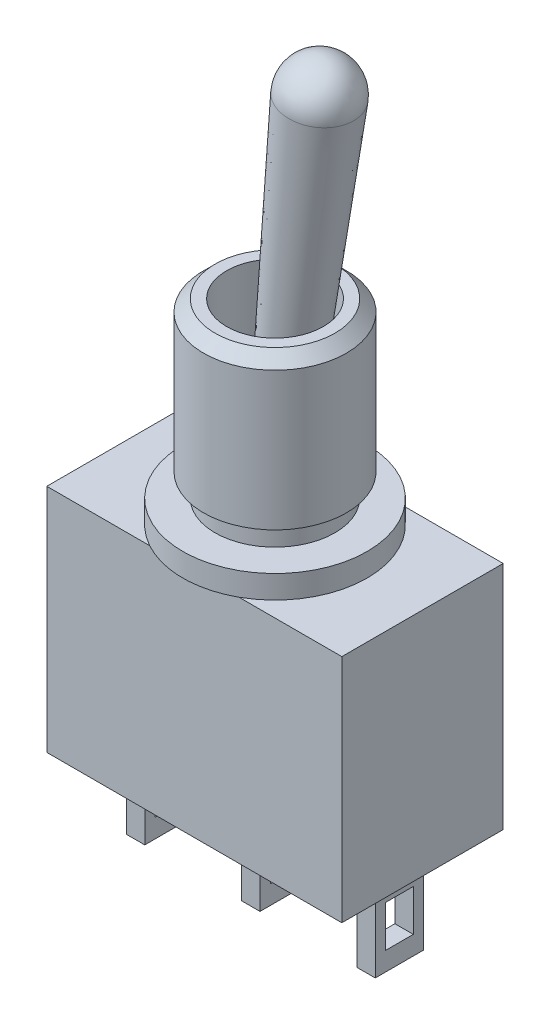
from build123d import *

# Parameters (mm, degrees)
SKETCH1_W           = 12.8
SKETCH1_H           = 10
BOSS_EXTRUDE1_DEPTH = 3.5
SKETCH4_W           = 2.1
SKETCH4_H           = 3.8
SKETCH4_W_2         = 1.2
SKETCH4_H_2         = 1.8
BOSS_EXTRUDE2_DEPTH = 0.4
LPATTERN1_COUNT     = 2
LPATTERN1_PITCH     = 5
LPATTERN1_COL_COUNT = 2
LPATTERN1_COL_PITCH = 5


with BuildPart() as part:
    # Sketch1 → Boss-Extrude1 (new, symmetric)
    with BuildSketch(Plane.XY):
        Rectangle(SKETCH1_W, SKETCH1_H)
    extrude(amount=BOSS_EXTRUDE1_DEPTH, both=True)

    # Sketch3 → Revolve1 (revolve)
    with BuildSketch(Plane.XY):
        with BuildLine():
            Line((0, 5), (0, 8.1))
            ThreePointArc((0, 8.1), (1.48492424, 7.48492424), (2.1, 6))
            Line((2.1, 6), (2.1, 13.5))
            Line((2.1, 13.5), (2.6, 13.5))
            Line((2.6, 13.5), (3.1, 13))
            Line((3.1, 13), (3.1, 7))
            Line((3.1, 7), (2.6, 7))
            Line((2.6, 7), (2.6, 6))
            Line((2.6, 6), (4, 6))
            Line((4, 6), (4, 5))
            Line((4, 5), (0, 5))
        make_face()
    revolve(axis=Axis((0, 5, 0), (0, 1, 0)))

    # Sketch4 → Boss-Extrude2 (add, symmetric)
    with BuildSketch(Plane(origin=(0, 0, 0), x_dir=(0, 0, -1), z_dir=(1, 0, 0))):
        with Locations((0, -6.9)):
            Rectangle(SKETCH4_W, SKETCH4_H)
        with Locations((0, -7.085714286)):
            Rectangle(SKETCH4_W_2, SKETCH4_H_2, mode=Mode.SUBTRACT)
    boss_extrude2 = extrude(amount=BOSS_EXTRUDE2_DEPTH, both=True)

    # LPattern1: Boss-Extrude2 ×2
    with Locations(*[(i * LPATTERN1_PITCH, 0, 0) for i in range(1, LPATTERN1_COUNT)]):
        add(boss_extrude2)

    # LPattern1 col: Boss-Extrude2 ×2
    with Locations(*[(-i * LPATTERN1_COL_PITCH, 0, 0) for i in range(1, LPATTERN1_COL_COUNT)]):
        add(boss_extrude2)


with BuildPart() as body_2:
    # Sketch5 → Revolve4 (revolve)
    with BuildSketch(Plane.XY):
        with BuildLine():
            Line((2.113131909, 23.613833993), (0.914491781, 13.685930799))
            Line((0.914491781, 13.685930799), (2.1, 13.5))
            Line((2.1, 13.5), (3.416038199, 21.891154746))
            ThreePointArc((3.416038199, 21.891154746), (3.130331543, 23.029117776), (2.113131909, 23.613833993))
        make_face()
        Polygon((0.914491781, 13.685930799), (0, 6.111525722), (0.923727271, 6), (2.1, 13.5), align=None)
    revolve(axis=Axis((0, 6.111525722, 0), (0.11986401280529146, 0.9927903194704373, 0)))


solid = Compound([part.part, body_2.part])
